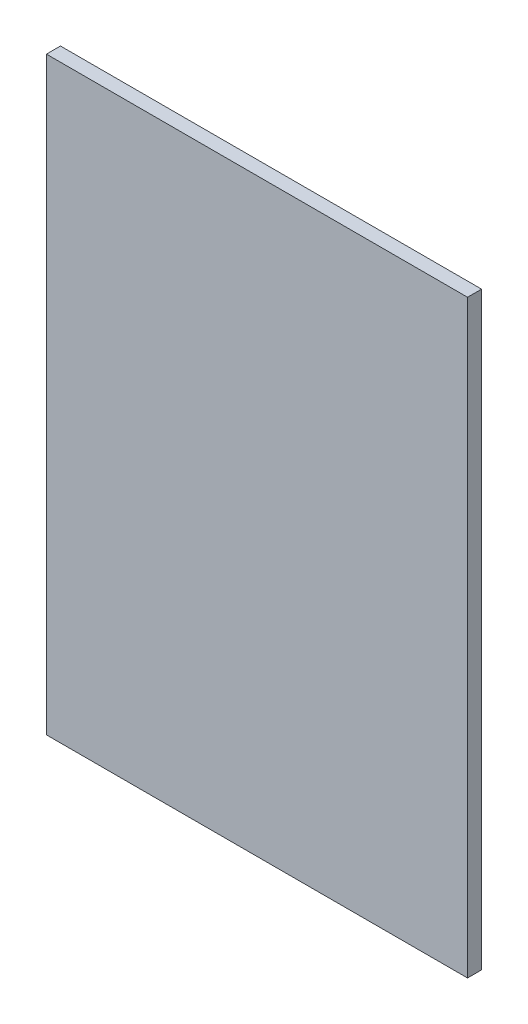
ISO-10303-21;
HEADER;
FILE_DESCRIPTION(('STEP AP214'),'2;1');
FILE_NAME('part.step','',(''),(''),'','','');
FILE_SCHEMA(('AUTOMOTIVE_DESIGN { 1 0 10303 214 1 1 1 1 }'));
ENDSEC;
DATA;
#1=APPLICATION_CONTEXT('core data for automotive mechanical design processes');
#2=APPLICATION_PROTOCOL_DEFINITION('international standard','automotive_design',2000,#1);
#3=PRODUCT_CONTEXT('',#1,'mechanical');
#4=PRODUCT('Part','Part','',(#3));
#5=PRODUCT_RELATED_PRODUCT_CATEGORY('part','',(#4));
#6=PRODUCT_DEFINITION_FORMATION('','',#4);
#7=PRODUCT_DEFINITION_CONTEXT('part definition',#1,'design');
#8=PRODUCT_DEFINITION('design','',#6,#7);
#9=PRODUCT_DEFINITION_SHAPE('','',#8);
#10=(LENGTH_UNIT() NAMED_UNIT(*) SI_UNIT(.MILLI.,.METRE.));
#11=(NAMED_UNIT(*) PLANE_ANGLE_UNIT() SI_UNIT($,.RADIAN.));
#12=(NAMED_UNIT(*) SI_UNIT($,.STERADIAN.) SOLID_ANGLE_UNIT());
#13=UNCERTAINTY_MEASURE_WITH_UNIT(LENGTH_MEASURE(1.E-05),#10,'distance_accuracy_value','');
#14=(GEOMETRIC_REPRESENTATION_CONTEXT(3) GLOBAL_UNCERTAINTY_ASSIGNED_CONTEXT((#13)) GLOBAL_UNIT_ASSIGNED_CONTEXT((#10,
#11,#12)) REPRESENTATION_CONTEXT('',''));
#15=CARTESIAN_POINT('',(0.,0.,0.));
#16=DIRECTION('',(0.,0.,1.));
#17=DIRECTION('',(1.,0.,0.));
#18=AXIS2_PLACEMENT_3D('',#15,#16,#17);
#19=CARTESIAN_POINT('',(-7.50000024,-10.49999932,0.5));
#20=DIRECTION('',(0.,0.,1.));
#21=DIRECTION('',(1.,0.,0.));
#22=AXIS2_PLACEMENT_3D('',#19,#20,#21);
#23=PLANE('',#22);
#24=DIRECTION('',(1.,0.,0.));
#25=VECTOR('',#24,1.);
#26=CARTESIAN_POINT('',(-7.50000024,10.50000186,0.5));
#27=LINE('',#26,#25);
#28=CARTESIAN_POINT('',(-7.50000024,10.50000186,0.5));
#29=VERTEX_POINT('',#28);
#30=CARTESIAN_POINT('',(7.50000024,10.50000186,0.5));
#31=VERTEX_POINT('',#30);
#32=EDGE_CURVE('E53',#29,#31,#27,.T.);
#33=ORIENTED_EDGE('',*,*,#32,.F.);
#34=DIRECTION('',(0.,1.,0.));
#35=VECTOR('',#34,1.);
#36=CARTESIAN_POINT('',(-7.50000024,-10.49999932,0.5));
#37=LINE('',#36,#35);
#38=CARTESIAN_POINT('',(-7.50000024,-10.49999932,0.5));
#39=VERTEX_POINT('',#38);
#40=EDGE_CURVE('E68',#39,#29,#37,.T.);
#41=ORIENTED_EDGE('',*,*,#40,.F.);
#42=DIRECTION('',(1.,0.,0.));
#43=VECTOR('',#42,1.);
#44=CARTESIAN_POINT('',(7.50000024,-10.49999932,0.5));
#45=LINE('',#44,#43);
#46=CARTESIAN_POINT('',(7.50000024,-10.49999932,0.5));
#47=VERTEX_POINT('',#46);
#48=EDGE_CURVE('E20',#47,#39,#45,.F.);
#49=ORIENTED_EDGE('',*,*,#48,.F.);
#50=DIRECTION('',(0.,1.,0.));
#51=VECTOR('',#50,1.);
#52=CARTESIAN_POINT('',(7.50000024,10.50000186,0.5));
#53=LINE('',#52,#51);
#54=EDGE_CURVE('E58',#31,#47,#53,.F.);
#55=ORIENTED_EDGE('',*,*,#54,.F.);
#56=EDGE_LOOP('',(#33,#41,#49,#55));
#57=FACE_BOUND('',#56,.T.);
#58=ADVANCED_FACE('F17',(#57),#23,.T.);
#59=CARTESIAN_POINT('',(7.50000024,-10.49999932,0.));
#60=DIRECTION('',(0.,-1.,0.));
#61=DIRECTION('',(0.,0.,-1.));
#62=AXIS2_PLACEMENT_3D('',#59,#60,#61);
#63=PLANE('',#62);
#64=DIRECTION('',(0.,0.,1.));
#65=VECTOR('',#64,1.);
#66=CARTESIAN_POINT('',(-7.50000024,-10.49999932,0.));
#67=LINE('',#66,#65);
#68=CARTESIAN_POINT('',(-7.50000024,-10.49999932,0.));
#69=VERTEX_POINT('',#68);
#70=EDGE_CURVE('E79',#69,#39,#67,.T.);
#71=ORIENTED_EDGE('',*,*,#70,.F.);
#72=DIRECTION('',(1.,0.,0.));
#73=VECTOR('',#72,1.);
#74=CARTESIAN_POINT('',(-7.50000024,-10.49999932,0.));
#75=LINE('',#74,#73);
#76=CARTESIAN_POINT('',(7.50000024,-10.49999932,0.));
#77=VERTEX_POINT('',#76);
#78=EDGE_CURVE('E74',#69,#77,#75,.T.);
#79=ORIENTED_EDGE('',*,*,#78,.T.);
#80=DIRECTION('',(0.,0.,-1.));
#81=VECTOR('',#80,1.);
#82=CARTESIAN_POINT('',(7.50000024,-10.49999932,0.));
#83=LINE('',#82,#81);
#84=EDGE_CURVE('E63',#47,#77,#83,.T.);
#85=ORIENTED_EDGE('',*,*,#84,.F.);
#86=ORIENTED_EDGE('',*,*,#48,.T.);
#87=EDGE_LOOP('',(#71,#79,#85,#86));
#88=FACE_BOUND('',#87,.T.);
#89=ADVANCED_FACE('F73',(#88),#63,.T.);
#90=CARTESIAN_POINT('',(7.50000024,10.50000186,0.));
#91=DIRECTION('',(1.,0.,0.));
#92=DIRECTION('',(0.,0.,-1.));
#93=AXIS2_PLACEMENT_3D('',#90,#91,#92);
#94=PLANE('',#93);
#95=ORIENTED_EDGE('',*,*,#84,.T.);
#96=DIRECTION('',(0.,1.,0.));
#97=VECTOR('',#96,1.);
#98=CARTESIAN_POINT('',(7.50000024,-10.49999932,0.));
#99=LINE('',#98,#97);
#100=CARTESIAN_POINT('',(7.50000024,10.50000186,0.));
#101=VERTEX_POINT('',#100);
#102=EDGE_CURVE('E84',#77,#101,#99,.T.);
#103=ORIENTED_EDGE('',*,*,#102,.T.);
#104=DIRECTION('',(0.,0.,1.));
#105=VECTOR('',#104,1.);
#106=CARTESIAN_POINT('',(7.50000024,10.50000186,0.));
#107=LINE('',#106,#105);
#108=EDGE_CURVE('E65',#31,#101,#107,.F.);
#109=ORIENTED_EDGE('',*,*,#108,.F.);
#110=ORIENTED_EDGE('',*,*,#54,.T.);
#111=EDGE_LOOP('',(#95,#103,#109,#110));
#112=FACE_BOUND('',#111,.T.);
#113=ADVANCED_FACE('F60',(#112),#94,.T.);
#114=CARTESIAN_POINT('',(-7.50000024,10.50000186,0.));
#115=DIRECTION('',(0.,1.,0.));
#116=DIRECTION('',(0.,0.,1.));
#117=AXIS2_PLACEMENT_3D('',#114,#115,#116);
#118=PLANE('',#117);
#119=ORIENTED_EDGE('',*,*,#108,.T.);
#120=DIRECTION('',(1.,0.,0.));
#121=VECTOR('',#120,1.);
#122=CARTESIAN_POINT('',(-7.50000024,10.50000186,0.));
#123=LINE('',#122,#121);
#124=CARTESIAN_POINT('',(-7.50000024,10.50000186,0.));
#125=VERTEX_POINT('',#124);
#126=EDGE_CURVE('E26',#101,#125,#123,.F.);
#127=ORIENTED_EDGE('',*,*,#126,.T.);
#128=DIRECTION('',(0.,0.,1.));
#129=VECTOR('',#128,1.);
#130=CARTESIAN_POINT('',(-7.50000024,10.50000186,0.));
#131=LINE('',#130,#129);
#132=EDGE_CURVE('E34',#29,#125,#131,.F.);
#133=ORIENTED_EDGE('',*,*,#132,.F.);
#134=ORIENTED_EDGE('',*,*,#32,.T.);
#135=EDGE_LOOP('',(#119,#127,#133,#134));
#136=FACE_BOUND('',#135,.T.);
#137=ADVANCED_FACE('F88',(#136),#118,.T.);
#138=CARTESIAN_POINT('',(-7.50000024,-10.49999932,0.));
#139=DIRECTION('',(-1.,0.,0.));
#140=DIRECTION('',(0.,0.,1.));
#141=AXIS2_PLACEMENT_3D('',#138,#139,#140);
#142=PLANE('',#141);
#143=ORIENTED_EDGE('',*,*,#132,.T.);
#144=DIRECTION('',(0.,1.,0.));
#145=VECTOR('',#144,1.);
#146=CARTESIAN_POINT('',(-7.50000024,-10.49999932,0.));
#147=LINE('',#146,#145);
#148=EDGE_CURVE('E11',#125,#69,#147,.F.);
#149=ORIENTED_EDGE('',*,*,#148,.T.);
#150=ORIENTED_EDGE('',*,*,#70,.T.);
#151=ORIENTED_EDGE('',*,*,#40,.T.);
#152=EDGE_LOOP('',(#143,#149,#150,#151));
#153=FACE_BOUND('',#152,.T.);
#154=ADVANCED_FACE('F91',(#153),#142,.T.);
#155=CARTESIAN_POINT('',(-7.50000024,-10.49999932,0.));
#156=DIRECTION('',(0.,0.,1.));
#157=DIRECTION('',(1.,0.,0.));
#158=AXIS2_PLACEMENT_3D('',#155,#156,#157);
#159=PLANE('',#158);
#160=ORIENTED_EDGE('',*,*,#126,.F.);
#161=ORIENTED_EDGE('',*,*,#102,.F.);
#162=ORIENTED_EDGE('',*,*,#78,.F.);
#163=ORIENTED_EDGE('',*,*,#148,.F.);
#164=EDGE_LOOP('',(#160,#161,#162,#163));
#165=FACE_BOUND('',#164,.T.);
#166=ADVANCED_FACE('F90',(#165),#159,.F.);
#167=CLOSED_SHELL('',(#58,#89,#113,#137,#154,#166));
#168=MANIFOLD_SOLID_BREP('B1',#167);
#169=ADVANCED_BREP_SHAPE_REPRESENTATION('',(#18,#168),#14);
#170=SHAPE_DEFINITION_REPRESENTATION(#9,#169);
ENDSEC;
END-ISO-10303-21;
